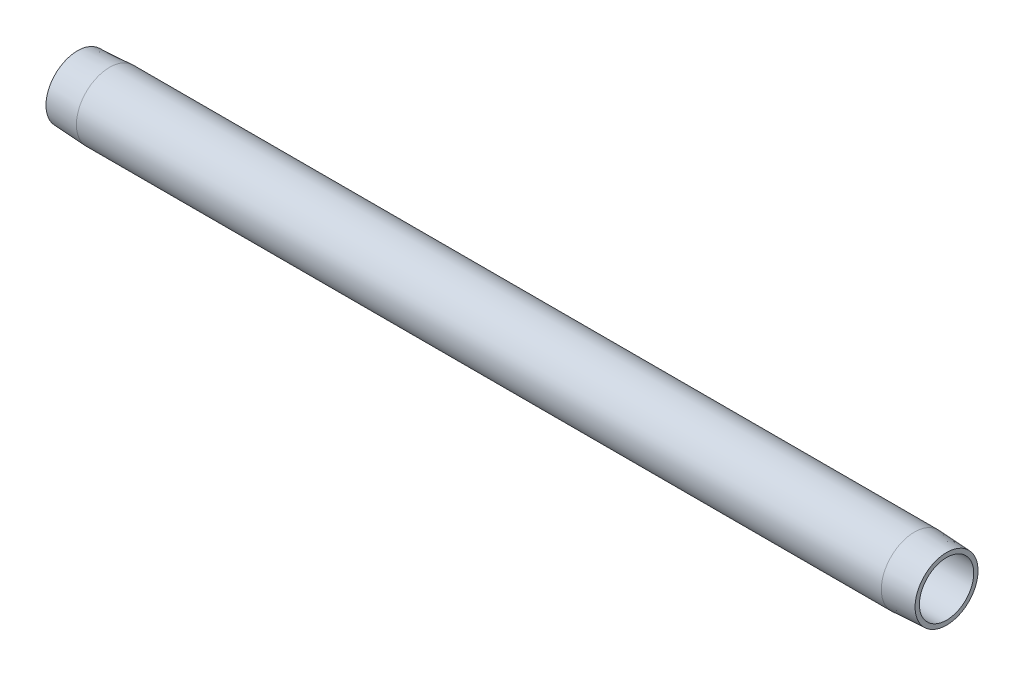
from build123d import *


with BuildPart() as part:
    # Sketch1 → Revolve1 (revolve)
    with BuildSketch(Plane.XY, mode=Mode.PRIVATE) as revolve1_sk:
        Polygon((279.4, 8.73125), (0, 8.73125), (0, 10.127550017), (10.3124, 10.668), (269.0876, 10.668), (279.4, 10.127550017), align=None)
    revolve(revolve1_sk.sketch.rotate(Axis((0, 0, 0), (1, 0, 0)), 90), axis=Axis((0, 0, 0), (1, 0, 0)))


solid = part.part
